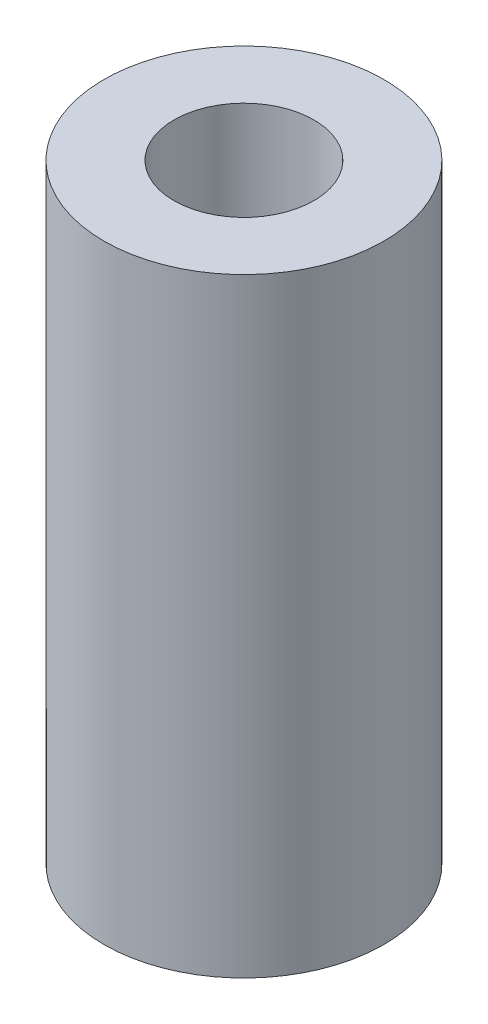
ISO-10303-21;
HEADER;
FILE_DESCRIPTION(('STEP AP214'),'2;1');
FILE_NAME('part.step','',(''),(''),'','','');
FILE_SCHEMA(('AUTOMOTIVE_DESIGN { 1 0 10303 214 1 1 1 1 }'));
ENDSEC;
DATA;
#1=APPLICATION_CONTEXT('core data for automotive mechanical design processes');
#2=APPLICATION_PROTOCOL_DEFINITION('international standard','automotive_design',2000,#1);
#3=PRODUCT_CONTEXT('',#1,'mechanical');
#4=PRODUCT('Part','Part','',(#3));
#5=PRODUCT_RELATED_PRODUCT_CATEGORY('part','',(#4));
#6=PRODUCT_DEFINITION_FORMATION('','',#4);
#7=PRODUCT_DEFINITION_CONTEXT('part definition',#1,'design');
#8=PRODUCT_DEFINITION('design','',#6,#7);
#9=PRODUCT_DEFINITION_SHAPE('','',#8);
#10=(LENGTH_UNIT() NAMED_UNIT(*) SI_UNIT(.MILLI.,.METRE.));
#11=(NAMED_UNIT(*) PLANE_ANGLE_UNIT() SI_UNIT($,.RADIAN.));
#12=(NAMED_UNIT(*) SI_UNIT($,.STERADIAN.) SOLID_ANGLE_UNIT());
#13=UNCERTAINTY_MEASURE_WITH_UNIT(LENGTH_MEASURE(1.E-05),#10,'distance_accuracy_value','');
#14=(GEOMETRIC_REPRESENTATION_CONTEXT(3) GLOBAL_UNCERTAINTY_ASSIGNED_CONTEXT((#13)) GLOBAL_UNIT_ASSIGNED_CONTEXT((#10,
#11,#12)) REPRESENTATION_CONTEXT('',''));
#15=CARTESIAN_POINT('',(0.,0.,0.));
#16=DIRECTION('',(0.,0.,1.));
#17=DIRECTION('',(1.,0.,0.));
#18=AXIS2_PLACEMENT_3D('',#15,#16,#17);
#19=CARTESIAN_POINT('',(0.,41.4528,0.));
#20=DIRECTION('',(0.,1.,0.));
#21=DIRECTION('',(0.,0.,1.));
#22=AXIS2_PLACEMENT_3D('',#19,#20,#21);
#23=PLANE('',#22);
#24=CARTESIAN_POINT('',(0.,41.4528,0.));
#25=DIRECTION('',(0.,1.,0.));
#26=DIRECTION('',(0.,0.,1.));
#27=AXIS2_PLACEMENT_3D('',#24,#25,#26);
#28=CIRCLE('',#27,19.05);
#29=CARTESIAN_POINT('',(0.,41.4528,19.05));
#30=VERTEX_POINT('',#29);
#31=EDGE_CURVE('E10',#30,#30,#28,.T.);
#32=ORIENTED_EDGE('',*,*,#31,.T.);
#33=EDGE_LOOP('',(#32));
#34=FACE_BOUND('',#33,.T.);
#35=CARTESIAN_POINT('',(0.,41.4528,0.));
#36=DIRECTION('',(0.,1.,0.));
#37=DIRECTION('',(0.,0.,1.));
#38=AXIS2_PLACEMENT_3D('',#35,#36,#37);
#39=CIRCLE('',#38,9.525);
#40=CARTESIAN_POINT('',(0.,41.4528,9.52500000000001));
#41=VERTEX_POINT('',#40);
#42=EDGE_CURVE('E39',#41,#41,#39,.T.);
#43=ORIENTED_EDGE('',*,*,#42,.F.);
#44=EDGE_LOOP('',(#43));
#45=FACE_BOUND('',#44,.T.);
#46=ADVANCED_FACE('F28',(#34,#45),#23,.T.);
#47=CARTESIAN_POINT('',(0.,-41.4528,0.));
#48=DIRECTION('',(0.,1.,0.));
#49=DIRECTION('',(0.,0.,1.));
#50=AXIS2_PLACEMENT_3D('',#47,#48,#49);
#51=PLANE('',#50);
#52=CARTESIAN_POINT('',(0.,-41.4528,0.));
#53=DIRECTION('',(0.,1.,0.));
#54=DIRECTION('',(0.,0.,1.));
#55=AXIS2_PLACEMENT_3D('',#52,#53,#54);
#56=CIRCLE('',#55,19.05);
#57=CARTESIAN_POINT('',(0.,-41.4528,19.05));
#58=VERTEX_POINT('',#57);
#59=EDGE_CURVE('E32',#58,#58,#56,.T.);
#60=ORIENTED_EDGE('',*,*,#59,.F.);
#61=EDGE_LOOP('',(#60));
#62=FACE_BOUND('',#61,.T.);
#63=CARTESIAN_POINT('',(0.,-41.4528,0.));
#64=DIRECTION('',(0.,1.,0.));
#65=DIRECTION('',(0.,0.,1.));
#66=AXIS2_PLACEMENT_3D('',#63,#64,#65);
#67=CIRCLE('',#66,9.525);
#68=CARTESIAN_POINT('',(0.,-41.4528,9.52500000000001));
#69=VERTEX_POINT('',#68);
#70=EDGE_CURVE('E41',#69,#69,#67,.T.);
#71=ORIENTED_EDGE('',*,*,#70,.T.);
#72=EDGE_LOOP('',(#71));
#73=FACE_BOUND('',#72,.T.);
#74=ADVANCED_FACE('F51',(#62,#73),#51,.F.);
#75=CARTESIAN_POINT('',(0.,41.4528,0.));
#76=DIRECTION('',(0.,-1.,0.));
#77=DIRECTION('',(0.,0.,-1.));
#78=AXIS2_PLACEMENT_3D('',#75,#76,#77);
#79=CYLINDRICAL_SURFACE('',#78,19.05);
#80=ORIENTED_EDGE('',*,*,#31,.F.);
#81=EDGE_LOOP('',(#80));
#82=FACE_BOUND('',#81,.T.);
#83=ORIENTED_EDGE('',*,*,#59,.T.);
#84=EDGE_LOOP('',(#83));
#85=FACE_BOUND('',#84,.T.);
#86=ADVANCED_FACE('F30',(#82,#85),#79,.T.);
#87=CARTESIAN_POINT('',(0.,41.4528,0.));
#88=DIRECTION('',(0.,-1.,0.));
#89=DIRECTION('',(0.,0.,-1.));
#90=AXIS2_PLACEMENT_3D('',#87,#88,#89);
#91=CYLINDRICAL_SURFACE('',#90,9.525);
#92=ORIENTED_EDGE('',*,*,#42,.T.);
#93=EDGE_LOOP('',(#92));
#94=FACE_BOUND('',#93,.T.);
#95=ORIENTED_EDGE('',*,*,#70,.F.);
#96=EDGE_LOOP('',(#95));
#97=FACE_BOUND('',#96,.T.);
#98=ADVANCED_FACE('F47',(#94,#97),#91,.F.);
#99=CLOSED_SHELL('',(#46,#74,#86,#98));
#100=MANIFOLD_SOLID_BREP('B2',#99);
#101=ADVANCED_BREP_SHAPE_REPRESENTATION('',(#18,#100),#14);
#102=SHAPE_DEFINITION_REPRESENTATION(#9,#101);
ENDSEC;
END-ISO-10303-21;
